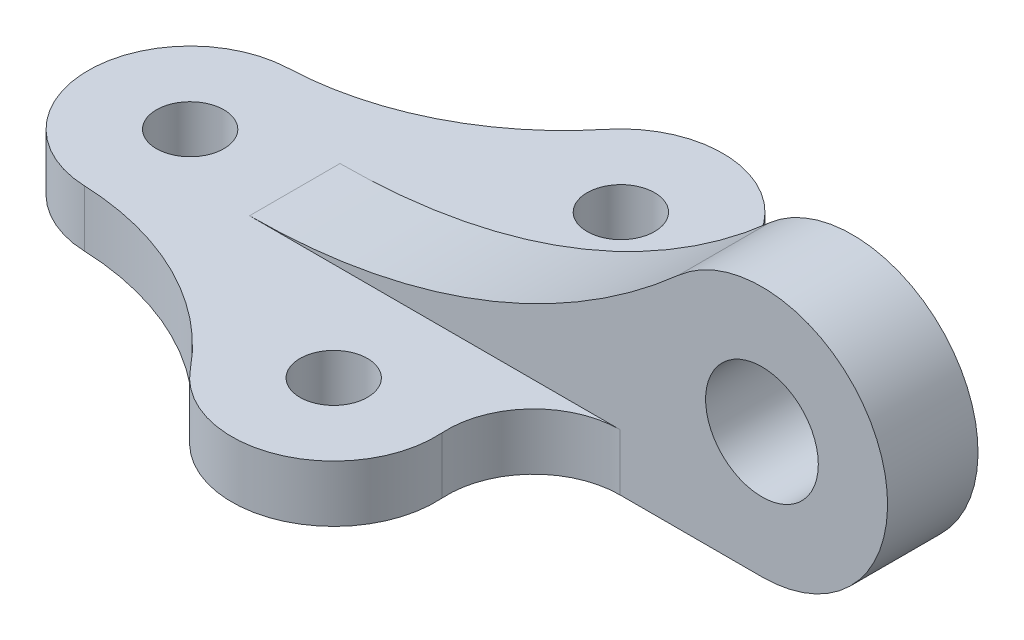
ISO-10303-21;
HEADER;
FILE_DESCRIPTION(('STEP AP214'),'2;1');
FILE_NAME('part.step','',(''),(''),'','','');
FILE_SCHEMA(('AUTOMOTIVE_DESIGN { 1 0 10303 214 1 1 1 1 }'));
ENDSEC;
DATA;
#1=APPLICATION_CONTEXT('core data for automotive mechanical design processes');
#2=APPLICATION_PROTOCOL_DEFINITION('international standard','automotive_design',2000,#1);
#3=PRODUCT_CONTEXT('',#1,'mechanical');
#4=PRODUCT('Part','Part','',(#3));
#5=PRODUCT_RELATED_PRODUCT_CATEGORY('part','',(#4));
#6=PRODUCT_DEFINITION_FORMATION('','',#4);
#7=PRODUCT_DEFINITION_CONTEXT('part definition',#1,'design');
#8=PRODUCT_DEFINITION('design','',#6,#7);
#9=PRODUCT_DEFINITION_SHAPE('','',#8);
#10=(LENGTH_UNIT() NAMED_UNIT(*) SI_UNIT(.MILLI.,.METRE.));
#11=(NAMED_UNIT(*) PLANE_ANGLE_UNIT() SI_UNIT($,.RADIAN.));
#12=(NAMED_UNIT(*) SI_UNIT($,.STERADIAN.) SOLID_ANGLE_UNIT());
#13=UNCERTAINTY_MEASURE_WITH_UNIT(LENGTH_MEASURE(1.E-05),#10,'distance_accuracy_value','');
#14=(GEOMETRIC_REPRESENTATION_CONTEXT(3) GLOBAL_UNCERTAINTY_ASSIGNED_CONTEXT((#13)) GLOBAL_UNIT_ASSIGNED_CONTEXT((#10,
#11,#12)) REPRESENTATION_CONTEXT('',''));
#15=CARTESIAN_POINT('',(0.,0.,0.));
#16=DIRECTION('',(0.,0.,1.));
#17=DIRECTION('',(1.,0.,0.));
#18=AXIS2_PLACEMENT_3D('',#15,#16,#17);
#19=CARTESIAN_POINT('',(84.0038822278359,10.0076,23.241));
#20=DIRECTION('',(0.,1.,0.));
#21=DIRECTION('',(0.,0.,1.));
#22=AXIS2_PLACEMENT_3D('',#19,#20,#21);
#23=PLANE('',#22);
#24=DIRECTION('',(1.,0.,0.));
#25=VECTOR('',#24,1.);
#26=CARTESIAN_POINT('',(84.0038822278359,10.0076,8.001));
#27=LINE('',#26,#25);
#28=CARTESIAN_POINT('',(18.5085183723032,10.0076,8.001));
#29=VERTEX_POINT('',#28);
#30=CARTESIAN_POINT('',(84.0038822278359,10.0076,8.001));
#31=VERTEX_POINT('',#30);
#32=EDGE_CURVE('E193',#29,#31,#27,.T.);
#33=ORIENTED_EDGE('',*,*,#32,.F.);
#34=DIRECTION('',(0.,0.,-1.));
#35=VECTOR('',#34,1.);
#36=CARTESIAN_POINT('',(18.5085183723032,10.0076,8.001));
#37=LINE('',#36,#35);
#38=CARTESIAN_POINT('',(18.5085183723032,10.0076,-8.001));
#39=VERTEX_POINT('',#38);
#40=EDGE_CURVE('E203',#29,#39,#37,.T.);
#41=ORIENTED_EDGE('',*,*,#40,.T.);
#42=DIRECTION('',(1.,0.,0.));
#43=VECTOR('',#42,1.);
#44=CARTESIAN_POINT('',(84.0038822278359,10.0076,-8.001));
#45=LINE('',#44,#43);
#46=CARTESIAN_POINT('',(84.0038822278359,10.0076,-8.001));
#47=VERTEX_POINT('',#46);
#48=EDGE_CURVE('E198',#39,#47,#45,.T.);
#49=ORIENTED_EDGE('',*,*,#48,.T.);
#50=CARTESIAN_POINT('',(84.0038822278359,10.0076,-23.241));
#51=DIRECTION('',(0.,-1.,0.));
#52=DIRECTION('',(0.,0.,1.));
#53=AXIS2_PLACEMENT_3D('',#50,#51,#52);
#54=CIRCLE('',#53,15.24);
#55=CARTESIAN_POINT('',(68.7959972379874,10.0076,-24.2298549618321));
#56=VERTEX_POINT('',#55);
#57=EDGE_CURVE('E91',#47,#56,#54,.T.);
#58=ORIENTED_EDGE('',*,*,#57,.T.);
#59=CARTESIAN_POINT('',(50.8,10.0076,-25.4));
#60=DIRECTION('',(0.,1.,0.));
#61=DIRECTION('',(0.,0.,1.));
#62=AXIS2_PLACEMENT_3D('',#59,#60,#61);
#63=CIRCLE('',#62,18.034);
#64=CARTESIAN_POINT('',(36.7986831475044,10.0076,-36.7661023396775));
#65=VERTEX_POINT('',#64);
#66=EDGE_CURVE('E173',#56,#65,#63,.T.);
#67=ORIENTED_EDGE('',*,*,#66,.T.);
#68=CARTESIAN_POINT('',(-2.64164601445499,10.0076,-68.78329202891));
#69=DIRECTION('',(0.,-1.,0.));
#70=DIRECTION('',(0.,0.,1.));
#71=AXIS2_PLACEMENT_3D('',#68,#69,#70);
#72=CIRCLE('',#71,50.8);
#73=CARTESIAN_POINT('',(-0.69209176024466,10.0076,-18.020714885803));
#74=VERTEX_POINT('',#73);
#75=EDGE_CURVE('E108',#65,#74,#72,.T.);
#76=ORIENTED_EDGE('',*,*,#75,.T.);
#77=CARTESIAN_POINT('',(0.,10.0076,0.));
#78=DIRECTION('',(0.,1.,0.));
#79=DIRECTION('',(0.,0.,1.));
#80=AXIS2_PLACEMENT_3D('',#77,#78,#79);
#81=CIRCLE('',#80,18.034);
#82=CARTESIAN_POINT('',(-0.692091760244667,10.0076,18.020714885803));
#83=VERTEX_POINT('',#82);
#84=EDGE_CURVE('E101',#74,#83,#81,.T.);
#85=ORIENTED_EDGE('',*,*,#84,.T.);
#86=CARTESIAN_POINT('',(-2.64164601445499,10.0076,68.78329202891));
#87=DIRECTION('',(0.,-1.,0.));
#88=DIRECTION('',(0.,0.,1.));
#89=AXIS2_PLACEMENT_3D('',#86,#87,#88);
#90=CIRCLE('',#89,50.8);
#91=CARTESIAN_POINT('',(36.7986831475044,10.0076,36.7661023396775));
#92=VERTEX_POINT('',#91);
#93=EDGE_CURVE('E106',#83,#92,#90,.T.);
#94=ORIENTED_EDGE('',*,*,#93,.T.);
#95=CARTESIAN_POINT('',(50.8,10.0076,25.4));
#96=DIRECTION('',(0.,1.,0.));
#97=DIRECTION('',(0.,0.,1.));
#98=AXIS2_PLACEMENT_3D('',#95,#96,#97);
#99=CIRCLE('',#98,18.034);
#100=CARTESIAN_POINT('',(68.7959972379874,10.0076,24.2298549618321));
#101=VERTEX_POINT('',#100);
#102=EDGE_CURVE('E50',#92,#101,#99,.T.);
#103=ORIENTED_EDGE('',*,*,#102,.T.);
#104=CARTESIAN_POINT('',(84.0038822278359,10.0076,23.241));
#105=DIRECTION('',(0.,-1.,0.));
#106=DIRECTION('',(0.,0.,1.));
#107=AXIS2_PLACEMENT_3D('',#104,#105,#106);
#108=CIRCLE('',#107,15.24);
#109=EDGE_CURVE('E139',#101,#31,#108,.T.);
#110=ORIENTED_EDGE('',*,*,#109,.T.);
#111=EDGE_LOOP('',(#33,#41,#49,#58,#67,#76,#85,#94,#103,#110));
#112=FACE_BOUND('',#111,.T.);
#113=CARTESIAN_POINT('',(50.8,10.0076,-25.4));
#114=DIRECTION('',(0.,1.,0.));
#115=DIRECTION('',(0.,0.,1.));
#116=AXIS2_PLACEMENT_3D('',#113,#114,#115);
#117=CIRCLE('',#116,5.969);
#118=CARTESIAN_POINT('',(50.8,10.0076,-19.431));
#119=VERTEX_POINT('',#118);
#120=EDGE_CURVE('E181',#119,#119,#117,.T.);
#121=ORIENTED_EDGE('',*,*,#120,.F.);
#122=EDGE_LOOP('',(#121));
#123=FACE_BOUND('',#122,.T.);
#124=CARTESIAN_POINT('',(0.,10.0076,0.));
#125=DIRECTION('',(0.,1.,0.));
#126=DIRECTION('',(0.,0.,1.));
#127=AXIS2_PLACEMENT_3D('',#124,#125,#126);
#128=CIRCLE('',#127,5.969);
#129=CARTESIAN_POINT('',(0.,10.0076,5.969));
#130=VERTEX_POINT('',#129);
#131=EDGE_CURVE('E130',#130,#130,#128,.T.);
#132=ORIENTED_EDGE('',*,*,#131,.F.);
#133=EDGE_LOOP('',(#132));
#134=FACE_BOUND('',#133,.T.);
#135=CARTESIAN_POINT('',(50.8,10.0076,25.4));
#136=DIRECTION('',(0.,1.,0.));
#137=DIRECTION('',(0.,0.,1.));
#138=AXIS2_PLACEMENT_3D('',#135,#136,#137);
#139=CIRCLE('',#138,5.969);
#140=CARTESIAN_POINT('',(50.8,10.0076,31.369));
#141=VERTEX_POINT('',#140);
#142=EDGE_CURVE('E187',#141,#141,#139,.T.);
#143=ORIENTED_EDGE('',*,*,#142,.F.);
#144=EDGE_LOOP('',(#143));
#145=FACE_BOUND('',#144,.T.);
#146=ADVANCED_FACE('F33',(#112,#123,#134,#145),#23,.T.);
#147=CARTESIAN_POINT('',(84.0038822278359,0.,23.241));
#148=DIRECTION('',(0.,1.,0.));
#149=DIRECTION('',(0.,0.,1.));
#150=AXIS2_PLACEMENT_3D('',#147,#148,#149);
#151=PLANE('',#150);
#152=DIRECTION('',(1.,0.,0.));
#153=VECTOR('',#152,1.);
#154=CARTESIAN_POINT('',(109.162908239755,0.,8.001));
#155=LINE('',#154,#153);
#156=CARTESIAN_POINT('',(84.0038822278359,0.,8.001));
#157=VERTEX_POINT('',#156);
#158=CARTESIAN_POINT('',(109.162908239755,0.,8.001));
#159=VERTEX_POINT('',#158);
#160=EDGE_CURVE('E208',#157,#159,#155,.T.);
#161=ORIENTED_EDGE('',*,*,#160,.F.);
#162=CARTESIAN_POINT('',(84.0038822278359,0.,23.241));
#163=DIRECTION('',(0.,-1.,0.));
#164=DIRECTION('',(0.,0.,1.));
#165=AXIS2_PLACEMENT_3D('',#162,#163,#164);
#166=CIRCLE('',#165,15.24);
#167=CARTESIAN_POINT('',(68.7959972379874,0.,24.2298549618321));
#168=VERTEX_POINT('',#167);
#169=EDGE_CURVE('E126',#168,#157,#166,.T.);
#170=ORIENTED_EDGE('',*,*,#169,.F.);
#171=CARTESIAN_POINT('',(50.8,0.,25.4));
#172=DIRECTION('',(0.,1.,0.));
#173=DIRECTION('',(0.,0.,1.));
#174=AXIS2_PLACEMENT_3D('',#171,#172,#173);
#175=CIRCLE('',#174,18.034);
#176=CARTESIAN_POINT('',(36.7986831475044,0.,36.7661023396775));
#177=VERTEX_POINT('',#176);
#178=EDGE_CURVE('E83',#177,#168,#175,.T.);
#179=ORIENTED_EDGE('',*,*,#178,.F.);
#180=CARTESIAN_POINT('',(-2.64164601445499,0.,68.78329202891));
#181=DIRECTION('',(0.,-1.,0.));
#182=DIRECTION('',(0.,0.,1.));
#183=AXIS2_PLACEMENT_3D('',#180,#181,#182);
#184=CIRCLE('',#183,50.8);
#185=CARTESIAN_POINT('',(-0.692091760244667,0.,18.020714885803));
#186=VERTEX_POINT('',#185);
#187=EDGE_CURVE('E77',#186,#177,#184,.T.);
#188=ORIENTED_EDGE('',*,*,#187,.F.);
#189=CARTESIAN_POINT('',(0.,0.,0.));
#190=DIRECTION('',(0.,1.,0.));
#191=DIRECTION('',(0.,0.,1.));
#192=AXIS2_PLACEMENT_3D('',#189,#190,#191);
#193=CIRCLE('',#192,18.034);
#194=CARTESIAN_POINT('',(-0.69209176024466,0.,-18.020714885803));
#195=VERTEX_POINT('',#194);
#196=EDGE_CURVE('E116',#195,#186,#193,.T.);
#197=ORIENTED_EDGE('',*,*,#196,.F.);
#198=CARTESIAN_POINT('',(-2.64164601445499,0.,-68.78329202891));
#199=DIRECTION('',(0.,-1.,0.));
#200=DIRECTION('',(0.,0.,1.));
#201=AXIS2_PLACEMENT_3D('',#198,#199,#200);
#202=CIRCLE('',#201,50.8);
#203=CARTESIAN_POINT('',(36.7986831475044,0.,-36.7661023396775));
#204=VERTEX_POINT('',#203);
#205=EDGE_CURVE('E134',#204,#195,#202,.T.);
#206=ORIENTED_EDGE('',*,*,#205,.F.);
#207=CARTESIAN_POINT('',(50.8,0.,-25.4));
#208=DIRECTION('',(0.,1.,0.));
#209=DIRECTION('',(0.,0.,1.));
#210=AXIS2_PLACEMENT_3D('',#207,#208,#209);
#211=CIRCLE('',#210,18.034);
#212=CARTESIAN_POINT('',(68.7959972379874,0.,-24.2298549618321));
#213=VERTEX_POINT('',#212);
#214=EDGE_CURVE('E132',#213,#204,#211,.T.);
#215=ORIENTED_EDGE('',*,*,#214,.F.);
#216=CARTESIAN_POINT('',(84.0038822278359,0.,-23.241));
#217=DIRECTION('',(0.,-1.,0.));
#218=DIRECTION('',(0.,0.,1.));
#219=AXIS2_PLACEMENT_3D('',#216,#217,#218);
#220=CIRCLE('',#219,15.24);
#221=CARTESIAN_POINT('',(84.0038822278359,0.,-8.001));
#222=VERTEX_POINT('',#221);
#223=EDGE_CURVE('E129',#222,#213,#220,.T.);
#224=ORIENTED_EDGE('',*,*,#223,.F.);
#225=DIRECTION('',(1.,0.,0.));
#226=VECTOR('',#225,1.);
#227=CARTESIAN_POINT('',(109.162908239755,0.,-8.001));
#228=LINE('',#227,#226);
#229=CARTESIAN_POINT('',(109.162908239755,0.,-8.001));
#230=VERTEX_POINT('',#229);
#231=EDGE_CURVE('E164',#222,#230,#228,.T.);
#232=ORIENTED_EDGE('',*,*,#231,.T.);
#233=DIRECTION('',(0.,0.,-1.));
#234=VECTOR('',#233,1.);
#235=CARTESIAN_POINT('',(109.162908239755,0.,8.001));
#236=LINE('',#235,#234);
#237=EDGE_CURVE('E206',#159,#230,#236,.T.);
#238=ORIENTED_EDGE('',*,*,#237,.F.);
#239=EDGE_LOOP('',(#161,#170,#179,#188,#197,#206,#215,#224,#232,#238));
#240=FACE_BOUND('',#239,.T.);
#241=CARTESIAN_POINT('',(50.8,0.,-25.4));
#242=DIRECTION('',(0.,1.,0.));
#243=DIRECTION('',(0.,0.,1.));
#244=AXIS2_PLACEMENT_3D('',#241,#242,#243);
#245=CIRCLE('',#244,5.969);
#246=CARTESIAN_POINT('',(50.8,0.,-19.431));
#247=VERTEX_POINT('',#246);
#248=EDGE_CURVE('E184',#247,#247,#245,.T.);
#249=ORIENTED_EDGE('',*,*,#248,.T.);
#250=EDGE_LOOP('',(#249));
#251=FACE_BOUND('',#250,.T.);
#252=CARTESIAN_POINT('',(0.,0.,0.));
#253=DIRECTION('',(0.,1.,0.));
#254=DIRECTION('',(0.,0.,1.));
#255=AXIS2_PLACEMENT_3D('',#252,#253,#254);
#256=CIRCLE('',#255,5.969);
#257=CARTESIAN_POINT('',(0.,0.,5.969));
#258=VERTEX_POINT('',#257);
#259=EDGE_CURVE('E178',#258,#258,#256,.T.);
#260=ORIENTED_EDGE('',*,*,#259,.T.);
#261=EDGE_LOOP('',(#260));
#262=FACE_BOUND('',#261,.T.);
#263=CARTESIAN_POINT('',(50.8,0.,25.4));
#264=DIRECTION('',(0.,1.,0.));
#265=DIRECTION('',(0.,0.,1.));
#266=AXIS2_PLACEMENT_3D('',#263,#264,#265);
#267=CIRCLE('',#266,5.969);
#268=CARTESIAN_POINT('',(50.8,0.,31.369));
#269=VERTEX_POINT('',#268);
#270=EDGE_CURVE('E190',#269,#269,#267,.T.);
#271=ORIENTED_EDGE('',*,*,#270,.T.);
#272=EDGE_LOOP('',(#271));
#273=FACE_BOUND('',#272,.T.);
#274=ADVANCED_FACE('F160',(#240,#251,#262,#273),#151,.F.);
#275=CARTESIAN_POINT('',(84.0038822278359,10.0076,23.241));
#276=DIRECTION('',(0.,-1.,0.));
#277=DIRECTION('',(0.,0.,-1.));
#278=AXIS2_PLACEMENT_3D('',#275,#276,#277);
#279=CYLINDRICAL_SURFACE('',#278,15.24);
#280=ORIENTED_EDGE('',*,*,#169,.T.);
#281=DIRECTION('',(0.,-1.,0.));
#282=VECTOR('',#281,1.);
#283=CARTESIAN_POINT('',(84.0038822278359,10.0076,8.00099999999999));
#284=LINE('',#283,#282);
#285=EDGE_CURVE('E11',#31,#157,#284,.T.);
#286=ORIENTED_EDGE('',*,*,#285,.F.);
#287=ORIENTED_EDGE('',*,*,#109,.F.);
#288=DIRECTION('',(0.,-1.,0.));
#289=VECTOR('',#288,1.);
#290=CARTESIAN_POINT('',(68.7959972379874,10.0076,24.2298549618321));
#291=LINE('',#290,#289);
#292=EDGE_CURVE('E122',#101,#168,#291,.T.);
#293=ORIENTED_EDGE('',*,*,#292,.T.);
#294=EDGE_LOOP('',(#280,#286,#287,#293));
#295=FACE_BOUND('',#294,.T.);
#296=ADVANCED_FACE('F35',(#295),#279,.F.);
#297=CARTESIAN_POINT('',(84.0038822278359,10.0076,-23.241));
#298=DIRECTION('',(0.,-1.,0.));
#299=DIRECTION('',(0.,0.,-1.));
#300=AXIS2_PLACEMENT_3D('',#297,#298,#299);
#301=CYLINDRICAL_SURFACE('',#300,15.24);
#302=ORIENTED_EDGE('',*,*,#223,.T.);
#303=DIRECTION('',(0.,-1.,0.));
#304=VECTOR('',#303,1.);
#305=CARTESIAN_POINT('',(68.7959972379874,10.0076,-24.2298549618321));
#306=LINE('',#305,#304);
#307=EDGE_CURVE('E146',#56,#213,#306,.T.);
#308=ORIENTED_EDGE('',*,*,#307,.F.);
#309=ORIENTED_EDGE('',*,*,#57,.F.);
#310=DIRECTION('',(0.,-1.,0.));
#311=VECTOR('',#310,1.);
#312=CARTESIAN_POINT('',(84.0038822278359,10.0076,-8.001));
#313=LINE('',#312,#311);
#314=EDGE_CURVE('E42',#47,#222,#313,.T.);
#315=ORIENTED_EDGE('',*,*,#314,.T.);
#316=EDGE_LOOP('',(#302,#308,#309,#315));
#317=FACE_BOUND('',#316,.T.);
#318=ADVANCED_FACE('F152',(#317),#301,.F.);
#319=CARTESIAN_POINT('',(50.8,10.0076,-25.4));
#320=DIRECTION('',(0.,-1.,0.));
#321=DIRECTION('',(0.,0.,-1.));
#322=AXIS2_PLACEMENT_3D('',#319,#320,#321);
#323=CYLINDRICAL_SURFACE('',#322,18.034);
#324=ORIENTED_EDGE('',*,*,#214,.T.);
#325=DIRECTION('',(0.,-1.,0.));
#326=VECTOR('',#325,1.);
#327=CARTESIAN_POINT('',(36.7986831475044,10.0076,-36.7661023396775));
#328=LINE('',#327,#326);
#329=EDGE_CURVE('E143',#65,#204,#328,.T.);
#330=ORIENTED_EDGE('',*,*,#329,.F.);
#331=ORIENTED_EDGE('',*,*,#66,.F.);
#332=ORIENTED_EDGE('',*,*,#307,.T.);
#333=EDGE_LOOP('',(#324,#330,#331,#332));
#334=FACE_BOUND('',#333,.T.);
#335=ADVANCED_FACE('F169',(#334),#323,.T.);
#336=CARTESIAN_POINT('',(-2.64164601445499,10.0076,-68.78329202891));
#337=DIRECTION('',(0.,-1.,0.));
#338=DIRECTION('',(0.,0.,-1.));
#339=AXIS2_PLACEMENT_3D('',#336,#337,#338);
#340=CYLINDRICAL_SURFACE('',#339,50.8);
#341=ORIENTED_EDGE('',*,*,#205,.T.);
#342=DIRECTION('',(0.,-1.,0.));
#343=VECTOR('',#342,1.);
#344=CARTESIAN_POINT('',(-0.69209176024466,10.0076,-18.020714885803));
#345=LINE('',#344,#343);
#346=EDGE_CURVE('E117',#74,#195,#345,.T.);
#347=ORIENTED_EDGE('',*,*,#346,.F.);
#348=ORIENTED_EDGE('',*,*,#75,.F.);
#349=ORIENTED_EDGE('',*,*,#329,.T.);
#350=EDGE_LOOP('',(#341,#347,#348,#349));
#351=FACE_BOUND('',#350,.T.);
#352=ADVANCED_FACE('F172',(#351),#340,.F.);
#353=CARTESIAN_POINT('',(0.,10.0076,0.));
#354=DIRECTION('',(0.,-1.,0.));
#355=DIRECTION('',(0.,0.,-1.));
#356=AXIS2_PLACEMENT_3D('',#353,#354,#355);
#357=CYLINDRICAL_SURFACE('',#356,18.034);
#358=ORIENTED_EDGE('',*,*,#196,.T.);
#359=DIRECTION('',(0.,-1.,0.));
#360=VECTOR('',#359,1.);
#361=CARTESIAN_POINT('',(-0.692091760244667,10.0076,18.020714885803));
#362=LINE('',#361,#360);
#363=EDGE_CURVE('E113',#83,#186,#362,.T.);
#364=ORIENTED_EDGE('',*,*,#363,.F.);
#365=ORIENTED_EDGE('',*,*,#84,.F.);
#366=ORIENTED_EDGE('',*,*,#346,.T.);
#367=EDGE_LOOP('',(#358,#364,#365,#366));
#368=FACE_BOUND('',#367,.T.);
#369=ADVANCED_FACE('F114',(#368),#357,.T.);
#370=CARTESIAN_POINT('',(-2.64164601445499,10.0076,68.78329202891));
#371=DIRECTION('',(0.,-1.,0.));
#372=DIRECTION('',(0.,0.,-1.));
#373=AXIS2_PLACEMENT_3D('',#370,#371,#372);
#374=CYLINDRICAL_SURFACE('',#373,50.8);
#375=ORIENTED_EDGE('',*,*,#187,.T.);
#376=DIRECTION('',(0.,-1.,0.));
#377=VECTOR('',#376,1.);
#378=CARTESIAN_POINT('',(36.7986831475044,10.0076,36.7661023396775));
#379=LINE('',#378,#377);
#380=EDGE_CURVE('E118',#92,#177,#379,.T.);
#381=ORIENTED_EDGE('',*,*,#380,.F.);
#382=ORIENTED_EDGE('',*,*,#93,.F.);
#383=ORIENTED_EDGE('',*,*,#363,.T.);
#384=EDGE_LOOP('',(#375,#381,#382,#383));
#385=FACE_BOUND('',#384,.T.);
#386=ADVANCED_FACE('F120',(#385),#374,.F.);
#387=CARTESIAN_POINT('',(50.8,10.0076,25.4));
#388=DIRECTION('',(0.,-1.,0.));
#389=DIRECTION('',(0.,0.,-1.));
#390=AXIS2_PLACEMENT_3D('',#387,#388,#389);
#391=CYLINDRICAL_SURFACE('',#390,18.034);
#392=ORIENTED_EDGE('',*,*,#178,.T.);
#393=ORIENTED_EDGE('',*,*,#292,.F.);
#394=ORIENTED_EDGE('',*,*,#102,.F.);
#395=ORIENTED_EDGE('',*,*,#380,.T.);
#396=EDGE_LOOP('',(#392,#393,#394,#395));
#397=FACE_BOUND('',#396,.T.);
#398=ADVANCED_FACE('F262',(#397),#391,.T.);
#399=CARTESIAN_POINT('',(0.,10.0076,0.));
#400=DIRECTION('',(0.,-1.,0.));
#401=DIRECTION('',(0.,0.,-1.));
#402=AXIS2_PLACEMENT_3D('',#399,#400,#401);
#403=CYLINDRICAL_SURFACE('',#402,5.969);
#404=ORIENTED_EDGE('',*,*,#131,.T.);
#405=EDGE_LOOP('',(#404));
#406=FACE_BOUND('',#405,.T.);
#407=ORIENTED_EDGE('',*,*,#259,.F.);
#408=EDGE_LOOP('',(#407));
#409=FACE_BOUND('',#408,.T.);
#410=ADVANCED_FACE('F259',(#406,#409),#403,.F.);
#411=CARTESIAN_POINT('',(50.8,10.0076,-25.4));
#412=DIRECTION('',(0.,-1.,0.));
#413=DIRECTION('',(0.,0.,-1.));
#414=AXIS2_PLACEMENT_3D('',#411,#412,#413);
#415=CYLINDRICAL_SURFACE('',#414,5.969);
#416=ORIENTED_EDGE('',*,*,#120,.T.);
#417=EDGE_LOOP('',(#416));
#418=FACE_BOUND('',#417,.T.);
#419=ORIENTED_EDGE('',*,*,#248,.F.);
#420=EDGE_LOOP('',(#419));
#421=FACE_BOUND('',#420,.T.);
#422=ADVANCED_FACE('F247',(#418,#421),#415,.F.);
#423=CARTESIAN_POINT('',(50.8,10.0076,25.4));
#424=DIRECTION('',(0.,-1.,0.));
#425=DIRECTION('',(0.,0.,-1.));
#426=AXIS2_PLACEMENT_3D('',#423,#424,#425);
#427=CYLINDRICAL_SURFACE('',#426,5.969);
#428=ORIENTED_EDGE('',*,*,#142,.T.);
#429=EDGE_LOOP('',(#428));
#430=FACE_BOUND('',#429,.T.);
#431=ORIENTED_EDGE('',*,*,#270,.F.);
#432=EDGE_LOOP('',(#431));
#433=FACE_BOUND('',#432,.T.);
#434=ADVANCED_FACE('F237',(#430,#433),#427,.F.);
#435=CARTESIAN_POINT('',(109.162908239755,22.225,8.001));
#436=DIRECTION('',(0.,0.,1.));
#437=DIRECTION('',(1.,0.,0.));
#438=AXIS2_PLACEMENT_3D('',#435,#436,#437);
#439=PLANE('',#438);
#440=CARTESIAN_POINT('',(18.5085183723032,124.3076,8.001));
#441=DIRECTION('',(0.,0.,-1.));
#442=DIRECTION('',(1.,0.,0.));
#443=AXIS2_PLACEMENT_3D('',#440,#441,#442);
#444=CIRCLE('',#443,114.3);
#445=CARTESIAN_POINT('',(94.405216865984,38.8430976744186,8.001));
#446=VERTEX_POINT('',#445);
#447=EDGE_CURVE('E220',#446,#29,#444,.T.);
#448=ORIENTED_EDGE('',*,*,#447,.T.);
#449=ORIENTED_EDGE('',*,*,#32,.T.);
#450=ORIENTED_EDGE('',*,*,#285,.T.);
#451=ORIENTED_EDGE('',*,*,#160,.T.);
#452=CARTESIAN_POINT('',(109.162908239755,22.225,8.001));
#453=DIRECTION('',(0.,0.,1.));
#454=DIRECTION('',(1.,0.,0.));
#455=AXIS2_PLACEMENT_3D('',#452,#453,#454);
#456=CIRCLE('',#455,22.225);
#457=EDGE_CURVE('E210',#159,#446,#456,.T.);
#458=ORIENTED_EDGE('',*,*,#457,.T.);
#459=EDGE_LOOP('',(#448,#449,#450,#451,#458));
#460=FACE_BOUND('',#459,.T.);
#461=CARTESIAN_POINT('',(109.162908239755,22.225,8.001));
#462=DIRECTION('',(0.,0.,1.));
#463=DIRECTION('',(1.,0.,0.));
#464=AXIS2_PLACEMENT_3D('',#461,#462,#463);
#465=CIRCLE('',#464,9.9695);
#466=CARTESIAN_POINT('',(119.132408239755,22.225,8.001));
#467=VERTEX_POINT('',#466);
#468=EDGE_CURVE('E217',#467,#467,#465,.T.);
#469=ORIENTED_EDGE('',*,*,#468,.F.);
#470=EDGE_LOOP('',(#469));
#471=FACE_BOUND('',#470,.T.);
#472=ADVANCED_FACE('F234',(#460,#471),#439,.T.);
#473=CARTESIAN_POINT('',(109.162908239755,22.225,-8.001));
#474=DIRECTION('',(0.,0.,1.));
#475=DIRECTION('',(1.,0.,0.));
#476=AXIS2_PLACEMENT_3D('',#473,#474,#475);
#477=PLANE('',#476);
#478=ORIENTED_EDGE('',*,*,#48,.F.);
#479=CARTESIAN_POINT('',(18.5085183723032,124.3076,-8.001));
#480=DIRECTION('',(0.,0.,-1.));
#481=DIRECTION('',(1.,0.,0.));
#482=AXIS2_PLACEMENT_3D('',#479,#480,#481);
#483=CIRCLE('',#482,114.3);
#484=CARTESIAN_POINT('',(94.405216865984,38.8430976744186,-8.001));
#485=VERTEX_POINT('',#484);
#486=EDGE_CURVE('E211',#485,#39,#483,.T.);
#487=ORIENTED_EDGE('',*,*,#486,.F.);
#488=CARTESIAN_POINT('',(109.162908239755,22.225,-8.001));
#489=DIRECTION('',(0.,0.,1.));
#490=DIRECTION('',(1.,0.,0.));
#491=AXIS2_PLACEMENT_3D('',#488,#489,#490);
#492=CIRCLE('',#491,22.225);
#493=EDGE_CURVE('E214',#230,#485,#492,.T.);
#494=ORIENTED_EDGE('',*,*,#493,.F.);
#495=ORIENTED_EDGE('',*,*,#231,.F.);
#496=ORIENTED_EDGE('',*,*,#314,.F.);
#497=EDGE_LOOP('',(#478,#487,#494,#495,#496));
#498=FACE_BOUND('',#497,.T.);
#499=CARTESIAN_POINT('',(109.162908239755,22.225,-8.001));
#500=DIRECTION('',(0.,0.,1.));
#501=DIRECTION('',(1.,0.,0.));
#502=AXIS2_PLACEMENT_3D('',#499,#500,#501);
#503=CIRCLE('',#502,9.9695);
#504=CARTESIAN_POINT('',(119.132408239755,22.225,-8.001));
#505=VERTEX_POINT('',#504);
#506=EDGE_CURVE('E225',#505,#505,#503,.T.);
#507=ORIENTED_EDGE('',*,*,#506,.T.);
#508=EDGE_LOOP('',(#507));
#509=FACE_BOUND('',#508,.T.);
#510=ADVANCED_FACE('F236',(#498,#509),#477,.F.);
#511=CARTESIAN_POINT('',(109.162908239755,22.225,8.001));
#512=DIRECTION('',(0.,0.,-1.));
#513=DIRECTION('',(-1.,0.,0.));
#514=AXIS2_PLACEMENT_3D('',#511,#512,#513);
#515=CYLINDRICAL_SURFACE('',#514,22.225);
#516=ORIENTED_EDGE('',*,*,#493,.T.);
#517=DIRECTION('',(0.,0.,-1.));
#518=VECTOR('',#517,1.);
#519=CARTESIAN_POINT('',(94.405216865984,38.8430976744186,8.001));
#520=LINE('',#519,#518);
#521=EDGE_CURVE('E200',#446,#485,#520,.T.);
#522=ORIENTED_EDGE('',*,*,#521,.F.);
#523=ORIENTED_EDGE('',*,*,#457,.F.);
#524=ORIENTED_EDGE('',*,*,#237,.T.);
#525=EDGE_LOOP('',(#516,#522,#523,#524));
#526=FACE_BOUND('',#525,.T.);
#527=ADVANCED_FACE('F244',(#526),#515,.T.);
#528=CARTESIAN_POINT('',(18.5085183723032,124.3076,8.001));
#529=DIRECTION('',(0.,0.,-1.));
#530=DIRECTION('',(-1.,0.,0.));
#531=AXIS2_PLACEMENT_3D('',#528,#529,#530);
#532=CYLINDRICAL_SURFACE('',#531,114.3);
#533=ORIENTED_EDGE('',*,*,#486,.T.);
#534=ORIENTED_EDGE('',*,*,#40,.F.);
#535=ORIENTED_EDGE('',*,*,#447,.F.);
#536=ORIENTED_EDGE('',*,*,#521,.T.);
#537=EDGE_LOOP('',(#533,#534,#535,#536));
#538=FACE_BOUND('',#537,.T.);
#539=ADVANCED_FACE('F301',(#538),#532,.F.);
#540=CARTESIAN_POINT('',(109.162908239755,22.225,8.001));
#541=DIRECTION('',(0.,0.,-1.));
#542=DIRECTION('',(-1.,0.,0.));
#543=AXIS2_PLACEMENT_3D('',#540,#541,#542);
#544=CYLINDRICAL_SURFACE('',#543,9.9695);
#545=ORIENTED_EDGE('',*,*,#468,.T.);
#546=EDGE_LOOP('',(#545));
#547=FACE_BOUND('',#546,.T.);
#548=ORIENTED_EDGE('',*,*,#506,.F.);
#549=EDGE_LOOP('',(#548));
#550=FACE_BOUND('',#549,.T.);
#551=ADVANCED_FACE('F231',(#547,#550),#544,.F.);
#552=CLOSED_SHELL('',(#146,#274,#296,#318,#335,#352,#369,#386,#398,#410,#422,#434,#472,#510,
#527,#539,#551));
#553=MANIFOLD_SOLID_BREP('B2',#552);
#554=ADVANCED_BREP_SHAPE_REPRESENTATION('',(#18,#553),#14);
#555=SHAPE_DEFINITION_REPRESENTATION(#9,#554);
ENDSEC;
END-ISO-10303-21;
